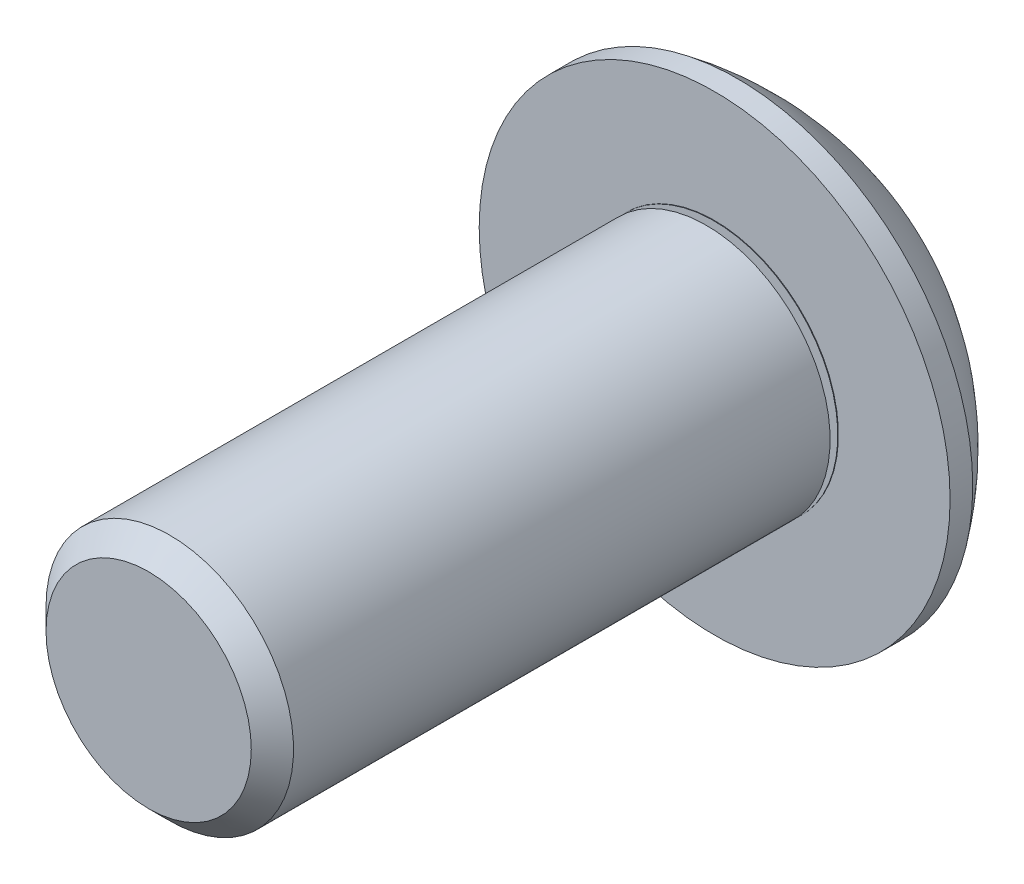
ISO-10303-21;
HEADER;
FILE_DESCRIPTION(('STEP AP214'),'2;1');
FILE_NAME('part.step','',(''),(''),'','','');
FILE_SCHEMA(('AUTOMOTIVE_DESIGN { 1 0 10303 214 1 1 1 1 }'));
ENDSEC;
DATA;
#1=APPLICATION_CONTEXT('core data for automotive mechanical design processes');
#2=APPLICATION_PROTOCOL_DEFINITION('international standard','automotive_design',2000,#1);
#3=PRODUCT_CONTEXT('',#1,'mechanical');
#4=PRODUCT('Part','Part','',(#3));
#5=PRODUCT_RELATED_PRODUCT_CATEGORY('part','',(#4));
#6=PRODUCT_DEFINITION_FORMATION('','',#4);
#7=PRODUCT_DEFINITION_CONTEXT('part definition',#1,'design');
#8=PRODUCT_DEFINITION('design','',#6,#7);
#9=PRODUCT_DEFINITION_SHAPE('','',#8);
#10=(LENGTH_UNIT() NAMED_UNIT(*) SI_UNIT(.MILLI.,.METRE.));
#11=(NAMED_UNIT(*) PLANE_ANGLE_UNIT() SI_UNIT($,.RADIAN.));
#12=(NAMED_UNIT(*) SI_UNIT($,.STERADIAN.) SOLID_ANGLE_UNIT());
#13=UNCERTAINTY_MEASURE_WITH_UNIT(LENGTH_MEASURE(1.E-05),#10,'distance_accuracy_value','');
#14=(GEOMETRIC_REPRESENTATION_CONTEXT(3) GLOBAL_UNCERTAINTY_ASSIGNED_CONTEXT((#13)) GLOBAL_UNIT_ASSIGNED_CONTEXT((#10,
#11,#12)) REPRESENTATION_CONTEXT('',''));
#15=CARTESIAN_POINT('',(0.,0.,0.));
#16=DIRECTION('',(0.,0.,1.));
#17=DIRECTION('',(1.,0.,0.));
#18=AXIS2_PLACEMENT_3D('',#15,#16,#17);
#19=CARTESIAN_POINT('',(0.,0.,2.59612424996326));
#20=DIRECTION('',(0.,0.,-1.));
#21=DIRECTION('',(-1.,0.,0.));
#22=AXIS2_PLACEMENT_3D('',#19,#20,#21);
#23=DEGENERATE_TOROIDAL_SURFACE('',#22,0.153803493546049,5.08,.F.);
#24=CARTESIAN_POINT('',(0.,0.,-2.2098));
#25=DIRECTION('',(0.,0.,-1.));
#26=DIRECTION('',(-1.,0.,0.));
#27=AXIS2_PLACEMENT_3D('',#24,#25,#26);
#28=CIRCLE('',#27,1.49225);
#29=CARTESIAN_POINT('',(-1.49225,0.,-2.2098));
#30=VERTEX_POINT('',#29);
#31=EDGE_CURVE('E11',#30,#30,#28,.T.);
#32=ORIENTED_EDGE('',*,*,#31,.F.);
#33=EDGE_LOOP('',(#32));
#34=FACE_BOUND('',#33,.T.);
#35=CARTESIAN_POINT('',(0.,0.,-0.380999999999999));
#36=DIRECTION('',(0.,0.,-1.));
#37=DIRECTION('',(-1.,0.,0.));
#38=AXIS2_PLACEMENT_3D('',#35,#36,#37);
#39=CIRCLE('',#38,3.96240000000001);
#40=CARTESIAN_POINT('',(-3.96240000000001,0.,-0.380999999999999));
#41=VERTEX_POINT('',#40);
#42=EDGE_CURVE('E164',#41,#41,#39,.T.);
#43=ORIENTED_EDGE('',*,*,#42,.T.);
#44=EDGE_LOOP('',(#43));
#45=FACE_BOUND('',#44,.T.);
#46=ADVANCED_FACE('F49',(#34,#45),#23,.F.);
#47=CARTESIAN_POINT('',(0.,0.,-2.2098));
#48=DIRECTION('',(0.,0.,1.));
#49=DIRECTION('',(1.,0.,0.));
#50=AXIS2_PLACEMENT_3D('',#47,#48,#49);
#51=PLANE('',#50);
#52=DIRECTION('',(-0.5,-0.866025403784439,0.));
#53=VECTOR('',#52,1.);
#54=CARTESIAN_POINT('',(1.37554856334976,0.,-2.2098));
#55=LINE('',#54,#53);
#56=CARTESIAN_POINT('',(1.37554856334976,0.,-2.2098));
#57=VERTEX_POINT('',#56);
#58=CARTESIAN_POINT('',(0.68777428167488,-1.19126,-2.2098));
#59=VERTEX_POINT('',#58);
#60=EDGE_CURVE('E145',#57,#59,#55,.T.);
#61=ORIENTED_EDGE('',*,*,#60,.F.);
#62=DIRECTION('',(0.5,-0.866025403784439,0.));
#63=VECTOR('',#62,1.);
#64=CARTESIAN_POINT('',(0.68777428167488,1.19126,-2.2098));
#65=LINE('',#64,#63);
#66=CARTESIAN_POINT('',(0.68777428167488,1.19126,-2.2098));
#67=VERTEX_POINT('',#66);
#68=EDGE_CURVE('E64',#67,#57,#65,.T.);
#69=ORIENTED_EDGE('',*,*,#68,.F.);
#70=DIRECTION('',(1.,0.,0.));
#71=VECTOR('',#70,1.);
#72=CARTESIAN_POINT('',(-0.68777428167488,1.19126,-2.2098));
#73=LINE('',#72,#71);
#74=CARTESIAN_POINT('',(-0.68777428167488,1.19126,-2.2098));
#75=VERTEX_POINT('',#74);
#76=EDGE_CURVE('E158',#75,#67,#73,.T.);
#77=ORIENTED_EDGE('',*,*,#76,.F.);
#78=DIRECTION('',(0.5,0.866025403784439,0.));
#79=VECTOR('',#78,1.);
#80=CARTESIAN_POINT('',(-1.37554856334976,0.,-2.2098));
#81=LINE('',#80,#79);
#82=CARTESIAN_POINT('',(-1.37554856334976,0.,-2.2098));
#83=VERTEX_POINT('',#82);
#84=EDGE_CURVE('E155',#83,#75,#81,.T.);
#85=ORIENTED_EDGE('',*,*,#84,.F.);
#86=DIRECTION('',(-0.5,0.866025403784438,0.));
#87=VECTOR('',#86,1.);
#88=CARTESIAN_POINT('',(-0.68777428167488,-1.19126,-2.2098));
#89=LINE('',#88,#87);
#90=CARTESIAN_POINT('',(-0.68777428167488,-1.19126,-2.2098));
#91=VERTEX_POINT('',#90);
#92=EDGE_CURVE('E112',#91,#83,#89,.T.);
#93=ORIENTED_EDGE('',*,*,#92,.F.);
#94=DIRECTION('',(-1.,0.,0.));
#95=VECTOR('',#94,1.);
#96=CARTESIAN_POINT('',(0.68777428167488,-1.19126,-2.2098));
#97=LINE('',#96,#95);
#98=EDGE_CURVE('E149',#59,#91,#97,.T.);
#99=ORIENTED_EDGE('',*,*,#98,.F.);
#100=EDGE_LOOP('',(#61,#69,#77,#85,#93,#99));
#101=FACE_BOUND('',#100,.T.);
#102=ORIENTED_EDGE('',*,*,#31,.T.);
#103=EDGE_LOOP('',(#102));
#104=FACE_BOUND('',#103,.T.);
#105=ADVANCED_FACE('F213',(#101,#104),#51,.F.);
#106=CARTESIAN_POINT('',(-1.72719999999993,0.,9.525));
#107=DIRECTION('',(0.,0.,-1.));
#108=DIRECTION('',(-1.,0.,0.));
#109=AXIS2_PLACEMENT_3D('',#106,#107,#108);
#110=PLANE('',#109);
#111=CARTESIAN_POINT('',(0.,0.,9.525));
#112=DIRECTION('',(0.,0.,-1.));
#113=DIRECTION('',(-1.,0.,0.));
#114=AXIS2_PLACEMENT_3D('',#111,#112,#113);
#115=CIRCLE('',#114,1.72720000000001);
#116=CARTESIAN_POINT('',(-1.72720000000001,0.,9.525));
#117=VERTEX_POINT('',#116);
#118=EDGE_CURVE('E57',#117,#117,#115,.T.);
#119=ORIENTED_EDGE('',*,*,#118,.F.);
#120=EDGE_LOOP('',(#119));
#121=FACE_BOUND('',#120,.T.);
#122=ADVANCED_FACE('F211',(#121),#110,.F.);
#123=CARTESIAN_POINT('',(0.,0.,9.525));
#124=DIRECTION('',(0.,0.,-1.));
#125=DIRECTION('',(-1.,0.,0.));
#126=AXIS2_PLACEMENT_3D('',#123,#124,#125);
#127=CONICAL_SURFACE('',#126,1.72720000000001,0.78539816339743);
#128=CARTESIAN_POINT('',(0.,0.,9.16939999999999));
#129=DIRECTION('',(0.,0.,-1.));
#130=DIRECTION('',(-1.,0.,0.));
#131=AXIS2_PLACEMENT_3D('',#128,#129,#130);
#132=CIRCLE('',#131,2.08280000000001);
#133=CARTESIAN_POINT('',(-2.08280000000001,0.,9.16939999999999));
#134=VERTEX_POINT('',#133);
#135=EDGE_CURVE('E201',#134,#134,#132,.T.);
#136=ORIENTED_EDGE('',*,*,#135,.F.);
#137=EDGE_LOOP('',(#136));
#138=FACE_BOUND('',#137,.T.);
#139=ORIENTED_EDGE('',*,*,#118,.T.);
#140=EDGE_LOOP('',(#139));
#141=FACE_BOUND('',#140,.T.);
#142=ADVANCED_FACE('F209',(#138,#141),#127,.T.);
#143=CARTESIAN_POINT('',(0.,0.,-10.585154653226));
#144=DIRECTION('',(0.,0.,-1.));
#145=DIRECTION('',(-1.,0.,0.));
#146=AXIS2_PLACEMENT_3D('',#143,#144,#145);
#147=CYLINDRICAL_SURFACE('',#146,2.08280000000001);
#148=CARTESIAN_POINT('',(0.,0.,0.139427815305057));
#149=DIRECTION('',(0.,0.,-1.));
#150=DIRECTION('',(-1.,0.,0.));
#151=AXIS2_PLACEMENT_3D('',#148,#149,#150);
#152=CIRCLE('',#151,2.0828);
#153=CARTESIAN_POINT('',(-2.0828,0.,0.139427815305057));
#154=VERTEX_POINT('',#153);
#155=EDGE_CURVE('E197',#154,#154,#152,.T.);
#156=ORIENTED_EDGE('',*,*,#155,.F.);
#157=EDGE_LOOP('',(#156));
#158=FACE_BOUND('',#157,.T.);
#159=ORIENTED_EDGE('',*,*,#135,.T.);
#160=EDGE_LOOP('',(#159));
#161=FACE_BOUND('',#160,.T.);
#162=ADVANCED_FACE('F219',(#158,#161),#147,.T.);
#163=CARTESIAN_POINT('',(0.,0.,0.139427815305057));
#164=DIRECTION('',(0.,0.,1.));
#165=DIRECTION('',(1.,0.,0.));
#166=AXIS2_PLACEMENT_3D('',#163,#164,#165);
#167=CONICAL_SURFACE('',#166,2.0828,1.22173047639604);
#168=CARTESIAN_POINT('',(0.,0.,0.0487938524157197));
#169=DIRECTION('',(0.,0.,-1.));
#170=DIRECTION('',(-1.,0.,0.));
#171=AXIS2_PLACEMENT_3D('',#168,#169,#170);
#172=CIRCLE('',#171,1.83378523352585);
#173=CARTESIAN_POINT('',(-1.83378523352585,0.,0.0487938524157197));
#174=VERTEX_POINT('',#173);
#175=EDGE_CURVE('E193',#174,#174,#172,.T.);
#176=ORIENTED_EDGE('',*,*,#175,.F.);
#177=EDGE_LOOP('',(#176));
#178=FACE_BOUND('',#177,.T.);
#179=ORIENTED_EDGE('',*,*,#155,.T.);
#180=EDGE_LOOP('',(#179));
#181=FACE_BOUND('',#180,.T.);
#182=ADVANCED_FACE('F259',(#178,#181),#167,.T.);
#183=CARTESIAN_POINT('',(0.,0.,0.0300000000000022));
#184=DIRECTION('',(0.,0.,-1.));
#185=DIRECTION('',(-1.,0.,0.));
#186=AXIS2_PLACEMENT_3D('',#183,#184,#185);
#187=TOROIDAL_SURFACE('',#186,1.84062563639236,0.02);
#188=CARTESIAN_POINT('',(0.,0.,0.0100000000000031));
#189=DIRECTION('',(0.,0.,-1.));
#190=DIRECTION('',(-1.,0.,0.));
#191=AXIS2_PLACEMENT_3D('',#188,#189,#190);
#192=CIRCLE('',#191,1.84062563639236);
#193=CARTESIAN_POINT('',(-1.84062563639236,0.,0.0100000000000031));
#194=VERTEX_POINT('',#193);
#195=EDGE_CURVE('E189',#194,#194,#192,.T.);
#196=ORIENTED_EDGE('',*,*,#195,.F.);
#197=EDGE_LOOP('',(#196));
#198=FACE_BOUND('',#197,.T.);
#199=ORIENTED_EDGE('',*,*,#175,.T.);
#200=EDGE_LOOP('',(#199));
#201=FACE_BOUND('',#200,.T.);
#202=ADVANCED_FACE('F253',(#198,#201),#187,.F.);
#203=CARTESIAN_POINT('',(-2.08280000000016,0.,0.0100000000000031));
#204=DIRECTION('',(0.,0.,-1.));
#205=DIRECTION('',(-1.,0.,0.));
#206=AXIS2_PLACEMENT_3D('',#203,#204,#205);
#207=PLANE('',#206);
#208=CARTESIAN_POINT('',(0.,0.,0.0100000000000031));
#209=DIRECTION('',(0.,0.,-1.));
#210=DIRECTION('',(-1.,0.,0.));
#211=AXIS2_PLACEMENT_3D('',#208,#209,#210);
#212=CIRCLE('',#211,2.0828);
#213=CARTESIAN_POINT('',(-2.0828,0.,0.0100000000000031));
#214=VERTEX_POINT('',#213);
#215=EDGE_CURVE('E185',#214,#214,#212,.T.);
#216=ORIENTED_EDGE('',*,*,#215,.F.);
#217=EDGE_LOOP('',(#216));
#218=FACE_BOUND('',#217,.T.);
#219=ORIENTED_EDGE('',*,*,#195,.T.);
#220=EDGE_LOOP('',(#219));
#221=FACE_BOUND('',#220,.T.);
#222=ADVANCED_FACE('F247',(#218,#221),#207,.F.);
#223=CARTESIAN_POINT('',(0.,0.,-10.585154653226));
#224=DIRECTION('',(0.,0.,-1.));
#225=DIRECTION('',(-1.,0.,0.));
#226=AXIS2_PLACEMENT_3D('',#223,#224,#225);
#227=CYLINDRICAL_SURFACE('',#226,2.0828);
#228=CARTESIAN_POINT('',(0.,0.,0.));
#229=DIRECTION('',(0.,0.,-1.));
#230=DIRECTION('',(-1.,0.,0.));
#231=AXIS2_PLACEMENT_3D('',#228,#229,#230);
#232=CIRCLE('',#231,2.0828);
#233=CARTESIAN_POINT('',(-2.0828,0.,0.));
#234=VERTEX_POINT('',#233);
#235=EDGE_CURVE('E181',#234,#234,#232,.T.);
#236=ORIENTED_EDGE('',*,*,#235,.F.);
#237=EDGE_LOOP('',(#236));
#238=FACE_BOUND('',#237,.T.);
#239=ORIENTED_EDGE('',*,*,#215,.T.);
#240=EDGE_LOOP('',(#239));
#241=FACE_BOUND('',#240,.T.);
#242=ADVANCED_FACE('F241',(#238,#241),#227,.T.);
#243=CARTESIAN_POINT('',(-3.96240000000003,0.,0.));
#244=DIRECTION('',(0.,0.,-1.));
#245=DIRECTION('',(-1.,0.,0.));
#246=AXIS2_PLACEMENT_3D('',#243,#244,#245);
#247=PLANE('',#246);
#248=CARTESIAN_POINT('',(0.,0.,0.));
#249=DIRECTION('',(0.,0.,-1.));
#250=DIRECTION('',(-1.,0.,0.));
#251=AXIS2_PLACEMENT_3D('',#248,#249,#250);
#252=CIRCLE('',#251,3.96240000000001);
#253=CARTESIAN_POINT('',(-3.96240000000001,0.,0.));
#254=VERTEX_POINT('',#253);
#255=EDGE_CURVE('E177',#254,#254,#252,.T.);
#256=ORIENTED_EDGE('',*,*,#255,.F.);
#257=EDGE_LOOP('',(#256));
#258=FACE_BOUND('',#257,.T.);
#259=ORIENTED_EDGE('',*,*,#235,.T.);
#260=EDGE_LOOP('',(#259));
#261=FACE_BOUND('',#260,.T.);
#262=ADVANCED_FACE('F235',(#258,#261),#247,.F.);
#263=CARTESIAN_POINT('',(0.,0.,-10.585154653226));
#264=DIRECTION('',(0.,0.,-1.));
#265=DIRECTION('',(-1.,0.,0.));
#266=AXIS2_PLACEMENT_3D('',#263,#264,#265);
#267=CYLINDRICAL_SURFACE('',#266,3.96240000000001);
#268=ORIENTED_EDGE('',*,*,#42,.F.);
#269=EDGE_LOOP('',(#268));
#270=FACE_BOUND('',#269,.T.);
#271=ORIENTED_EDGE('',*,*,#255,.T.);
#272=EDGE_LOOP('',(#271));
#273=FACE_BOUND('',#272,.T.);
#274=ADVANCED_FACE('F231',(#270,#273),#267,.T.);
#275=CARTESIAN_POINT('',(0.68777428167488,1.19126,-0.888999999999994));
#276=DIRECTION('',(0.866025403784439,0.5,0.));
#277=DIRECTION('',(-0.5,0.866025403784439,0.));
#278=AXIS2_PLACEMENT_3D('',#275,#276,#277);
#279=PLANE('',#278);
#280=ORIENTED_EDGE('',*,*,#68,.T.);
#281=DIRECTION('',(0.,0.,-1.));
#282=VECTOR('',#281,1.);
#283=CARTESIAN_POINT('',(1.37554856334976,0.,-0.888999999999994));
#284=LINE('',#283,#282);
#285=CARTESIAN_POINT('',(1.37554856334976,0.,-0.888999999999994));
#286=VERTEX_POINT('',#285);
#287=EDGE_CURVE('E94',#286,#57,#284,.T.);
#288=ORIENTED_EDGE('',*,*,#287,.F.);
#289=DIRECTION('',(0.5,-0.866025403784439,0.));
#290=VECTOR('',#289,1.);
#291=CARTESIAN_POINT('',(0.68777428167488,1.19126,-0.888999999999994));
#292=LINE('',#291,#290);
#293=CARTESIAN_POINT('',(0.68777428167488,1.19126,-0.888999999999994));
#294=VERTEX_POINT('',#293);
#295=EDGE_CURVE('E161',#294,#286,#292,.T.);
#296=ORIENTED_EDGE('',*,*,#295,.F.);
#297=DIRECTION('',(0.,0.,-1.));
#298=VECTOR('',#297,1.);
#299=CARTESIAN_POINT('',(0.68777428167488,1.19126,-0.888999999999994));
#300=LINE('',#299,#298);
#301=EDGE_CURVE('E72',#294,#67,#300,.T.);
#302=ORIENTED_EDGE('',*,*,#301,.T.);
#303=EDGE_LOOP('',(#280,#288,#296,#302));
#304=FACE_BOUND('',#303,.T.);
#305=ADVANCED_FACE('F234',(#304),#279,.F.);
#306=CARTESIAN_POINT('',(-0.68777428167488,1.19126,-0.888999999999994));
#307=DIRECTION('',(0.,1.,0.));
#308=DIRECTION('',(0.,0.,1.));
#309=AXIS2_PLACEMENT_3D('',#306,#307,#308);
#310=PLANE('',#309);
#311=ORIENTED_EDGE('',*,*,#76,.T.);
#312=ORIENTED_EDGE('',*,*,#301,.F.);
#313=DIRECTION('',(1.,0.,0.));
#314=VECTOR('',#313,1.);
#315=CARTESIAN_POINT('',(-0.68777428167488,1.19126,-0.888999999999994));
#316=LINE('',#315,#314);
#317=CARTESIAN_POINT('',(-0.68777428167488,1.19126,-0.888999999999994));
#318=VERTEX_POINT('',#317);
#319=EDGE_CURVE('E126',#318,#294,#316,.T.);
#320=ORIENTED_EDGE('',*,*,#319,.F.);
#321=DIRECTION('',(0.,0.,-1.));
#322=VECTOR('',#321,1.);
#323=CARTESIAN_POINT('',(-0.68777428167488,1.19126,-0.888999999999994));
#324=LINE('',#323,#322);
#325=EDGE_CURVE('E117',#318,#75,#324,.T.);
#326=ORIENTED_EDGE('',*,*,#325,.T.);
#327=EDGE_LOOP('',(#311,#312,#320,#326));
#328=FACE_BOUND('',#327,.T.);
#329=ADVANCED_FACE('F277',(#328),#310,.F.);
#330=CARTESIAN_POINT('',(-1.37554856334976,0.,-0.888999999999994));
#331=DIRECTION('',(-0.866025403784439,0.5,0.));
#332=DIRECTION('',(-0.5,-0.866025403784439,0.));
#333=AXIS2_PLACEMENT_3D('',#330,#331,#332);
#334=PLANE('',#333);
#335=ORIENTED_EDGE('',*,*,#84,.T.);
#336=ORIENTED_EDGE('',*,*,#325,.F.);
#337=DIRECTION('',(0.5,0.866025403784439,0.));
#338=VECTOR('',#337,1.);
#339=CARTESIAN_POINT('',(-1.37554856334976,0.,-0.888999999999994));
#340=LINE('',#339,#338);
#341=CARTESIAN_POINT('',(-1.37554856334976,0.,-0.888999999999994));
#342=VERTEX_POINT('',#341);
#343=EDGE_CURVE('E121',#342,#318,#340,.T.);
#344=ORIENTED_EDGE('',*,*,#343,.F.);
#345=DIRECTION('',(0.,0.,-1.));
#346=VECTOR('',#345,1.);
#347=CARTESIAN_POINT('',(-1.37554856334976,0.,-0.888999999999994));
#348=LINE('',#347,#346);
#349=EDGE_CURVE('E105',#342,#83,#348,.T.);
#350=ORIENTED_EDGE('',*,*,#349,.T.);
#351=EDGE_LOOP('',(#335,#336,#344,#350));
#352=FACE_BOUND('',#351,.T.);
#353=ADVANCED_FACE('F122',(#352),#334,.F.);
#354=CARTESIAN_POINT('',(-0.68777428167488,-1.19126,-0.888999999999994));
#355=DIRECTION('',(-0.866025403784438,-0.500000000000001,0.));
#356=DIRECTION('',(0.500000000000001,-0.866025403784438,0.));
#357=AXIS2_PLACEMENT_3D('',#354,#355,#356);
#358=PLANE('',#357);
#359=ORIENTED_EDGE('',*,*,#92,.T.);
#360=ORIENTED_EDGE('',*,*,#349,.F.);
#361=DIRECTION('',(-0.5,0.866025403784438,0.));
#362=VECTOR('',#361,1.);
#363=CARTESIAN_POINT('',(-0.68777428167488,-1.19126,-0.888999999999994));
#364=LINE('',#363,#362);
#365=CARTESIAN_POINT('',(-0.68777428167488,-1.19126,-0.888999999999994));
#366=VERTEX_POINT('',#365);
#367=EDGE_CURVE('E109',#366,#342,#364,.T.);
#368=ORIENTED_EDGE('',*,*,#367,.F.);
#369=DIRECTION('',(0.,0.,-1.));
#370=VECTOR('',#369,1.);
#371=CARTESIAN_POINT('',(-0.68777428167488,-1.19126,-0.888999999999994));
#372=LINE('',#371,#370);
#373=EDGE_CURVE('E118',#366,#91,#372,.T.);
#374=ORIENTED_EDGE('',*,*,#373,.T.);
#375=EDGE_LOOP('',(#359,#360,#368,#374));
#376=FACE_BOUND('',#375,.T.);
#377=ADVANCED_FACE('F107',(#376),#358,.F.);
#378=CARTESIAN_POINT('',(0.68777428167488,-1.19126,-0.888999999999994));
#379=DIRECTION('',(0.,-1.,0.));
#380=DIRECTION('',(0.,0.,-1.));
#381=AXIS2_PLACEMENT_3D('',#378,#379,#380);
#382=PLANE('',#381);
#383=ORIENTED_EDGE('',*,*,#98,.T.);
#384=ORIENTED_EDGE('',*,*,#373,.F.);
#385=DIRECTION('',(-1.,0.,0.));
#386=VECTOR('',#385,1.);
#387=CARTESIAN_POINT('',(0.68777428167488,-1.19126,-0.888999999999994));
#388=LINE('',#387,#386);
#389=CARTESIAN_POINT('',(0.68777428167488,-1.19126,-0.888999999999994));
#390=VERTEX_POINT('',#389);
#391=EDGE_CURVE('E132',#390,#366,#388,.T.);
#392=ORIENTED_EDGE('',*,*,#391,.F.);
#393=DIRECTION('',(0.,0.,-1.));
#394=VECTOR('',#393,1.);
#395=CARTESIAN_POINT('',(0.68777428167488,-1.19126,-0.888999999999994));
#396=LINE('',#395,#394);
#397=EDGE_CURVE('E169',#390,#59,#396,.T.);
#398=ORIENTED_EDGE('',*,*,#397,.T.);
#399=EDGE_LOOP('',(#383,#384,#392,#398));
#400=FACE_BOUND('',#399,.T.);
#401=ADVANCED_FACE('F281',(#400),#382,.F.);
#402=CARTESIAN_POINT('',(1.37554856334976,0.,-0.888999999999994));
#403=DIRECTION('',(0.866025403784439,-0.5,0.));
#404=DIRECTION('',(0.5,0.866025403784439,0.));
#405=AXIS2_PLACEMENT_3D('',#402,#403,#404);
#406=PLANE('',#405);
#407=ORIENTED_EDGE('',*,*,#60,.T.);
#408=ORIENTED_EDGE('',*,*,#397,.F.);
#409=DIRECTION('',(-0.5,-0.866025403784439,0.));
#410=VECTOR('',#409,1.);
#411=CARTESIAN_POINT('',(1.37554856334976,0.,-0.888999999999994));
#412=LINE('',#411,#410);
#413=EDGE_CURVE('E137',#286,#390,#412,.T.);
#414=ORIENTED_EDGE('',*,*,#413,.F.);
#415=ORIENTED_EDGE('',*,*,#287,.T.);
#416=EDGE_LOOP('',(#407,#408,#414,#415));
#417=FACE_BOUND('',#416,.T.);
#418=ADVANCED_FACE('F278',(#417),#406,.F.);
#419=CARTESIAN_POINT('',(2.06332284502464,-1.19126,-0.888999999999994));
#420=DIRECTION('',(0.,0.,-1.));
#421=DIRECTION('',(-1.,0.,0.));
#422=AXIS2_PLACEMENT_3D('',#419,#420,#421);
#423=PLANE('',#422);
#424=ORIENTED_EDGE('',*,*,#295,.T.);
#425=ORIENTED_EDGE('',*,*,#413,.T.);
#426=ORIENTED_EDGE('',*,*,#391,.T.);
#427=ORIENTED_EDGE('',*,*,#367,.T.);
#428=ORIENTED_EDGE('',*,*,#343,.T.);
#429=ORIENTED_EDGE('',*,*,#319,.T.);
#430=EDGE_LOOP('',(#424,#425,#426,#427,#428,#429));
#431=FACE_BOUND('',#430,.T.);
#432=ADVANCED_FACE('F129',(#431),#423,.T.);
#433=CLOSED_SHELL('',(#46,#105,#122,#142,#162,#182,#202,#222,#242,#262,#274,#305,#329,#353,#377,
#401,#418,#432));
#434=MANIFOLD_SOLID_BREP('B2',#433);
#435=ADVANCED_BREP_SHAPE_REPRESENTATION('',(#18,#434),#14);
#436=SHAPE_DEFINITION_REPRESENTATION(#9,#435);
ENDSEC;
END-ISO-10303-21;
